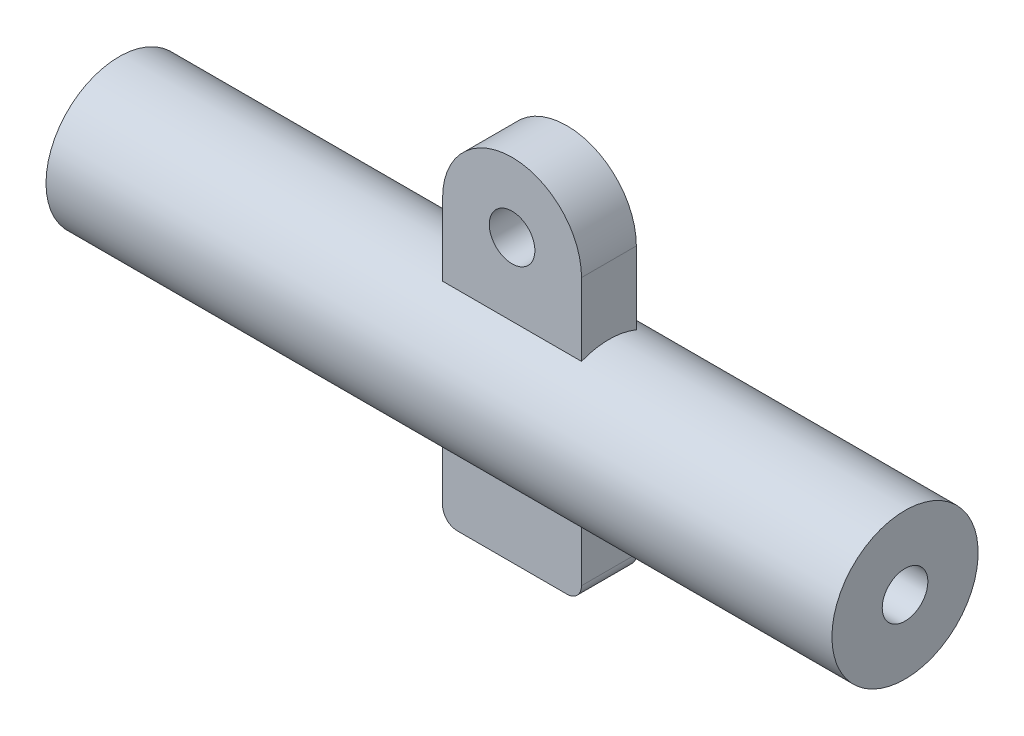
ISO-10303-21;
HEADER;
FILE_DESCRIPTION(('STEP AP214'),'2;1');
FILE_NAME('part.step','',(''),(''),'','','');
FILE_SCHEMA(('AUTOMOTIVE_DESIGN { 1 0 10303 214 1 1 1 1 }'));
ENDSEC;
DATA;
#1=APPLICATION_CONTEXT('core data for automotive mechanical design processes');
#2=APPLICATION_PROTOCOL_DEFINITION('international standard','automotive_design',2000,#1);
#3=PRODUCT_CONTEXT('',#1,'mechanical');
#4=PRODUCT('Part','Part','',(#3));
#5=PRODUCT_RELATED_PRODUCT_CATEGORY('part','',(#4));
#6=PRODUCT_DEFINITION_FORMATION('','',#4);
#7=PRODUCT_DEFINITION_CONTEXT('part definition',#1,'design');
#8=PRODUCT_DEFINITION('design','',#6,#7);
#9=PRODUCT_DEFINITION_SHAPE('','',#8);
#10=(LENGTH_UNIT() NAMED_UNIT(*) SI_UNIT(.MILLI.,.METRE.));
#11=(NAMED_UNIT(*) PLANE_ANGLE_UNIT() SI_UNIT($,.RADIAN.));
#12=(NAMED_UNIT(*) SI_UNIT($,.STERADIAN.) SOLID_ANGLE_UNIT());
#13=UNCERTAINTY_MEASURE_WITH_UNIT(LENGTH_MEASURE(1.E-05),#10,'distance_accuracy_value','');
#14=(GEOMETRIC_REPRESENTATION_CONTEXT(3) GLOBAL_UNCERTAINTY_ASSIGNED_CONTEXT((#13)) GLOBAL_UNIT_ASSIGNED_CONTEXT((#10,
#11,#12)) REPRESENTATION_CONTEXT('',''));
#15=CARTESIAN_POINT('',(0.,0.,0.));
#16=DIRECTION('',(0.,0.,1.));
#17=DIRECTION('',(1.,0.,0.));
#18=AXIS2_PLACEMENT_3D('',#15,#16,#17);
#19=CARTESIAN_POINT('',(0.,0.,0.));
#20=DIRECTION('',(-1.,0.,0.));
#21=DIRECTION('',(0.,0.,1.));
#22=AXIS2_PLACEMENT_3D('',#19,#20,#21);
#23=CYLINDRICAL_SURFACE('',#22,3.9624);
#24=CARTESIAN_POINT('',(0.,0.,0.));
#25=DIRECTION('',(-1.,0.,0.));
#26=DIRECTION('',(0.,0.,1.));
#27=AXIS2_PLACEMENT_3D('',#24,#25,#26);
#28=CIRCLE('',#27,3.9624);
#29=CARTESIAN_POINT('',(0.,0.,3.9624));
#30=VERTEX_POINT('',#29);
#31=EDGE_CURVE('E171',#30,#30,#28,.T.);
#32=ORIENTED_EDGE('',*,*,#31,.T.);
#33=EDGE_LOOP('',(#32));
#34=FACE_BOUND('',#33,.T.);
#35=CARTESIAN_POINT('',(60.96,0.,0.));
#36=DIRECTION('',(1.,0.,0.));
#37=DIRECTION('',(0.,1.,0.));
#38=AXIS2_PLACEMENT_3D('',#35,#36,#37);
#39=CIRCLE('',#38,3.9624);
#40=CARTESIAN_POINT('',(60.96,3.9624,0.));
#41=VERTEX_POINT('',#40);
#42=EDGE_CURVE('E158',#41,#41,#39,.F.);
#43=ORIENTED_EDGE('',*,*,#42,.F.);
#44=EDGE_LOOP('',(#43));
#45=FACE_BOUND('',#44,.T.);
#46=ADVANCED_FACE('F33',(#34,#45),#23,.F.);
#47=CARTESIAN_POINT('',(136.525,0.,0.));
#48=DIRECTION('',(-1.,0.,0.));
#49=DIRECTION('',(0.,0.,1.));
#50=AXIS2_PLACEMENT_3D('',#47,#48,#49);
#51=CIRCLE('',#50,3.9624);
#52=CARTESIAN_POINT('',(136.525,0.,3.9624));
#53=VERTEX_POINT('',#52);
#54=EDGE_CURVE('E168',#53,#53,#51,.T.);
#55=ORIENTED_EDGE('',*,*,#54,.F.);
#56=EDGE_LOOP('',(#55));
#57=FACE_BOUND('',#56,.T.);
#58=CARTESIAN_POINT('',(85.09,0.,0.));
#59=DIRECTION('',(-1.,0.,0.));
#60=DIRECTION('',(0.,-1.,0.));
#61=AXIS2_PLACEMENT_3D('',#58,#59,#60);
#62=CIRCLE('',#61,3.9624);
#63=CARTESIAN_POINT('',(85.09,-3.9624,0.));
#64=VERTEX_POINT('',#63);
#65=EDGE_CURVE('E155',#64,#64,#62,.F.);
#66=ORIENTED_EDGE('',*,*,#65,.F.);
#67=EDGE_LOOP('',(#66));
#68=FACE_BOUND('',#67,.T.);
#69=ADVANCED_FACE('F248',(#57,#68),#23,.F.);
#70=CARTESIAN_POINT('',(0.,0.,0.));
#71=DIRECTION('',(-1.,0.,0.));
#72=DIRECTION('',(0.,0.,1.));
#73=AXIS2_PLACEMENT_3D('',#70,#71,#72);
#74=CYLINDRICAL_SURFACE('',#73,12.7);
#75=CARTESIAN_POINT('',(60.96,0.,0.));
#76=DIRECTION('',(1.,0.,0.));
#77=DIRECTION('',(0.,1.,0.));
#78=AXIS2_PLACEMENT_3D('',#75,#76,#77);
#79=CIRCLE('',#78,12.7);
#80=CARTESIAN_POINT('',(60.96,-11.7732150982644,4.7625));
#81=VERTEX_POINT('',#80);
#82=CARTESIAN_POINT('',(60.96,-11.7732150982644,-4.7625));
#83=VERTEX_POINT('',#82);
#84=EDGE_CURVE('E184',#81,#83,#79,.T.);
#85=ORIENTED_EDGE('',*,*,#84,.F.);
#86=DIRECTION('',(-1.,0.,0.));
#87=VECTOR('',#86,1.);
#88=CARTESIAN_POINT('',(0.,-11.7732150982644,4.7625));
#89=LINE('',#88,#87);
#90=CARTESIAN_POINT('',(85.09,-11.7732150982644,4.7625));
#91=VERTEX_POINT('',#90);
#92=EDGE_CURVE('E181',#81,#91,#89,.F.);
#93=ORIENTED_EDGE('',*,*,#92,.T.);
#94=CARTESIAN_POINT('',(85.09,0.,0.));
#95=DIRECTION('',(-1.,0.,0.));
#96=DIRECTION('',(0.,-1.,0.));
#97=AXIS2_PLACEMENT_3D('',#94,#95,#96);
#98=CIRCLE('',#97,12.7);
#99=CARTESIAN_POINT('',(85.09,-11.7732150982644,-4.7625));
#100=VERTEX_POINT('',#99);
#101=EDGE_CURVE('E174',#100,#91,#98,.T.);
#102=ORIENTED_EDGE('',*,*,#101,.F.);
#103=DIRECTION('',(-1.,0.,0.));
#104=VECTOR('',#103,1.);
#105=CARTESIAN_POINT('',(0.,-11.7732150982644,-4.7625));
#106=LINE('',#105,#104);
#107=EDGE_CURVE('E177',#83,#100,#106,.F.);
#108=ORIENTED_EDGE('',*,*,#107,.F.);
#109=EDGE_LOOP('',(#85,#93,#102,#108));
#110=FACE_BOUND('',#109,.T.);
#111=CARTESIAN_POINT('',(0.,0.,0.));
#112=DIRECTION('',(-1.,0.,0.));
#113=DIRECTION('',(0.,0.,1.));
#114=AXIS2_PLACEMENT_3D('',#111,#112,#113);
#115=CIRCLE('',#114,12.7);
#116=CARTESIAN_POINT('',(0.,0.,12.7));
#117=VERTEX_POINT('',#116);
#118=EDGE_CURVE('E133',#117,#117,#115,.T.);
#119=ORIENTED_EDGE('',*,*,#118,.F.);
#120=EDGE_LOOP('',(#119));
#121=FACE_BOUND('',#120,.T.);
#122=CARTESIAN_POINT('',(136.525,0.,0.));
#123=DIRECTION('',(-1.,0.,0.));
#124=DIRECTION('',(0.,0.,1.));
#125=AXIS2_PLACEMENT_3D('',#122,#123,#124);
#126=CIRCLE('',#125,12.7);
#127=CARTESIAN_POINT('',(136.525,0.,12.7));
#128=VERTEX_POINT('',#127);
#129=EDGE_CURVE('E165',#128,#128,#126,.T.);
#130=ORIENTED_EDGE('',*,*,#129,.T.);
#131=EDGE_LOOP('',(#130));
#132=FACE_BOUND('',#131,.T.);
#133=CARTESIAN_POINT('',(60.96,11.7732150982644,-4.7625));
#134=VERTEX_POINT('',#133);
#135=CARTESIAN_POINT('',(60.96,11.7732150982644,4.7625));
#136=VERTEX_POINT('',#135);
#137=EDGE_CURVE('E159',#134,#136,#79,.T.);
#138=ORIENTED_EDGE('',*,*,#137,.F.);
#139=DIRECTION('',(-1.,0.,0.));
#140=VECTOR('',#139,1.);
#141=CARTESIAN_POINT('',(0.,11.7732150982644,-4.7625));
#142=LINE('',#141,#140);
#143=CARTESIAN_POINT('',(85.09,11.7732150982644,-4.7625));
#144=VERTEX_POINT('',#143);
#145=EDGE_CURVE('E187',#144,#134,#142,.T.);
#146=ORIENTED_EDGE('',*,*,#145,.F.);
#147=CARTESIAN_POINT('',(85.09,11.7732150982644,4.7625));
#148=VERTEX_POINT('',#147);
#149=EDGE_CURVE('E178',#148,#144,#98,.T.);
#150=ORIENTED_EDGE('',*,*,#149,.F.);
#151=DIRECTION('',(-1.,0.,0.));
#152=VECTOR('',#151,1.);
#153=CARTESIAN_POINT('',(0.,11.7732150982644,4.7625));
#154=LINE('',#153,#152);
#155=EDGE_CURVE('E120',#148,#136,#154,.T.);
#156=ORIENTED_EDGE('',*,*,#155,.T.);
#157=EDGE_LOOP('',(#138,#146,#150,#156));
#158=FACE_BOUND('',#157,.T.);
#159=ADVANCED_FACE('F230',(#110,#121,#132,#158),#74,.T.);
#160=CARTESIAN_POINT('',(0.,12.7,0.));
#161=DIRECTION('',(1.,0.,0.));
#162=DIRECTION('',(0.,0.,-1.));
#163=AXIS2_PLACEMENT_3D('',#160,#161,#162);
#164=PLANE('',#163);
#165=ORIENTED_EDGE('',*,*,#31,.F.);
#166=EDGE_LOOP('',(#165));
#167=FACE_BOUND('',#166,.T.);
#168=ORIENTED_EDGE('',*,*,#118,.T.);
#169=EDGE_LOOP('',(#168));
#170=FACE_BOUND('',#169,.T.);
#171=ADVANCED_FACE('F260',(#167,#170),#164,.F.);
#172=CARTESIAN_POINT('',(136.525,3.9624,0.));
#173=DIRECTION('',(-1.,0.,0.));
#174=DIRECTION('',(0.,0.,1.));
#175=AXIS2_PLACEMENT_3D('',#172,#173,#174);
#176=PLANE('',#175);
#177=ORIENTED_EDGE('',*,*,#129,.F.);
#178=EDGE_LOOP('',(#177));
#179=FACE_BOUND('',#178,.T.);
#180=ORIENTED_EDGE('',*,*,#54,.T.);
#181=EDGE_LOOP('',(#180));
#182=FACE_BOUND('',#181,.T.);
#183=ADVANCED_FACE('F258',(#179,#182),#176,.F.);
#184=CARTESIAN_POINT('',(60.96,-24.511,4.7625));
#185=DIRECTION('',(0.,1.,0.));
#186=DIRECTION('',(0.,0.,1.));
#187=AXIS2_PLACEMENT_3D('',#184,#185,#186);
#188=PLANE('',#187);
#189=DIRECTION('',(1.,0.,0.));
#190=VECTOR('',#189,1.);
#191=CARTESIAN_POINT('',(60.96,-24.511,4.7625));
#192=LINE('',#191,#190);
#193=CARTESIAN_POINT('',(63.5,-24.511,4.7625));
#194=VERTEX_POINT('',#193);
#195=CARTESIAN_POINT('',(82.55,-24.511,4.7625));
#196=VERTEX_POINT('',#195);
#197=EDGE_CURVE('E124',#194,#196,#192,.T.);
#198=ORIENTED_EDGE('',*,*,#197,.F.);
#199=DIRECTION('',(0.,0.,-1.));
#200=VECTOR('',#199,1.);
#201=CARTESIAN_POINT('',(63.5,-24.511,4.7625));
#202=LINE('',#201,#200);
#203=CARTESIAN_POINT('',(63.5,-24.511,-4.7625));
#204=VERTEX_POINT('',#203);
#205=EDGE_CURVE('E192',#194,#204,#202,.T.);
#206=ORIENTED_EDGE('',*,*,#205,.T.);
#207=DIRECTION('',(1.,0.,0.));
#208=VECTOR('',#207,1.);
#209=CARTESIAN_POINT('',(60.96,-24.511,-4.7625));
#210=LINE('',#209,#208);
#211=CARTESIAN_POINT('',(82.55,-24.511,-4.7625));
#212=VERTEX_POINT('',#211);
#213=EDGE_CURVE('E146',#204,#212,#210,.T.);
#214=ORIENTED_EDGE('',*,*,#213,.T.);
#215=DIRECTION('',(0.,0.,-1.));
#216=VECTOR('',#215,1.);
#217=CARTESIAN_POINT('',(82.55,-24.511,4.7625));
#218=LINE('',#217,#216);
#219=EDGE_CURVE('E162',#212,#196,#218,.F.);
#220=ORIENTED_EDGE('',*,*,#219,.T.);
#221=EDGE_LOOP('',(#198,#206,#214,#220));
#222=FACE_BOUND('',#221,.T.);
#223=ADVANCED_FACE('F207',(#222),#188,.F.);
#224=CARTESIAN_POINT('',(85.09,-24.511,4.7625));
#225=DIRECTION('',(-1.,0.,0.));
#226=DIRECTION('',(0.,-1.,0.));
#227=AXIS2_PLACEMENT_3D('',#224,#225,#226);
#228=PLANE('',#227);
#229=DIRECTION('',(0.,1.,0.));
#230=VECTOR('',#229,1.);
#231=CARTESIAN_POINT('',(85.09,-24.511,4.7625));
#232=LINE('',#231,#230);
#233=CARTESIAN_POINT('',(85.09,-21.971,4.7625));
#234=VERTEX_POINT('',#233);
#235=EDGE_CURVE('E123',#234,#91,#232,.T.);
#236=ORIENTED_EDGE('',*,*,#235,.F.);
#237=DIRECTION('',(0.,0.,-1.));
#238=VECTOR('',#237,1.);
#239=CARTESIAN_POINT('',(85.09,-21.971,4.7625));
#240=LINE('',#239,#238);
#241=CARTESIAN_POINT('',(85.09,-21.971,-4.7625));
#242=VERTEX_POINT('',#241);
#243=EDGE_CURVE('E11',#234,#242,#240,.T.);
#244=ORIENTED_EDGE('',*,*,#243,.T.);
#245=DIRECTION('',(0.,1.,0.));
#246=VECTOR('',#245,1.);
#247=CARTESIAN_POINT('',(85.09,-24.511,-4.7625));
#248=LINE('',#247,#246);
#249=EDGE_CURVE('E150',#242,#100,#248,.T.);
#250=ORIENTED_EDGE('',*,*,#249,.T.);
#251=ORIENTED_EDGE('',*,*,#101,.T.);
#252=EDGE_LOOP('',(#236,#244,#250,#251));
#253=FACE_BOUND('',#252,.T.);
#254=ADVANCED_FACE('F275',(#253),#228,.F.);
#255=CARTESIAN_POINT('',(60.96,24.384,4.7625));
#256=DIRECTION('',(1.,0.,0.));
#257=DIRECTION('',(0.,1.,0.));
#258=AXIS2_PLACEMENT_3D('',#255,#256,#257);
#259=PLANE('',#258);
#260=DIRECTION('',(0.,-1.,0.));
#261=VECTOR('',#260,1.);
#262=CARTESIAN_POINT('',(60.96,24.384,-4.7625));
#263=LINE('',#262,#261);
#264=CARTESIAN_POINT('',(60.96,-21.971,-4.7625));
#265=VERTEX_POINT('',#264);
#266=EDGE_CURVE('E147',#83,#265,#263,.T.);
#267=ORIENTED_EDGE('',*,*,#266,.T.);
#268=DIRECTION('',(0.,0.,-1.));
#269=VECTOR('',#268,1.);
#270=CARTESIAN_POINT('',(60.96,-21.971,4.7625));
#271=LINE('',#270,#269);
#272=CARTESIAN_POINT('',(60.96,-21.971,4.7625));
#273=VERTEX_POINT('',#272);
#274=EDGE_CURVE('E56',#265,#273,#271,.F.);
#275=ORIENTED_EDGE('',*,*,#274,.T.);
#276=DIRECTION('',(0.,-1.,0.));
#277=VECTOR('',#276,1.);
#278=CARTESIAN_POINT('',(60.96,24.384,4.7625));
#279=LINE('',#278,#277);
#280=EDGE_CURVE('E153',#81,#273,#279,.T.);
#281=ORIENTED_EDGE('',*,*,#280,.F.);
#282=ORIENTED_EDGE('',*,*,#84,.T.);
#283=EDGE_LOOP('',(#267,#275,#281,#282));
#284=FACE_BOUND('',#283,.T.);
#285=ADVANCED_FACE('F215',(#284),#259,.F.);
#286=CARTESIAN_POINT('',(73.025,24.384,-4.7625));
#287=DIRECTION('',(0.,0.,1.));
#288=DIRECTION('',(1.,0.,0.));
#289=AXIS2_PLACEMENT_3D('',#286,#287,#288);
#290=PLANE('',#289);
#291=ORIENTED_EDGE('',*,*,#213,.F.);
#292=CARTESIAN_POINT('',(63.5,-21.971,-4.7625));
#293=DIRECTION('',(0.,0.,1.));
#294=DIRECTION('',(1.,0.,0.));
#295=AXIS2_PLACEMENT_3D('',#292,#293,#294);
#296=CIRCLE('',#295,2.54);
#297=EDGE_CURVE('E197',#204,#265,#296,.F.);
#298=ORIENTED_EDGE('',*,*,#297,.T.);
#299=ORIENTED_EDGE('',*,*,#266,.F.);
#300=ORIENTED_EDGE('',*,*,#107,.T.);
#301=ORIENTED_EDGE('',*,*,#249,.F.);
#302=CARTESIAN_POINT('',(82.55,-21.971,-4.7625));
#303=DIRECTION('',(0.,0.,1.));
#304=DIRECTION('',(1.,0.,0.));
#305=AXIS2_PLACEMENT_3D('',#302,#303,#304);
#306=CIRCLE('',#305,2.54);
#307=EDGE_CURVE('E195',#242,#212,#306,.F.);
#308=ORIENTED_EDGE('',*,*,#307,.T.);
#309=EDGE_LOOP('',(#291,#298,#299,#300,#301,#308));
#310=FACE_BOUND('',#309,.T.);
#311=ADVANCED_FACE('F214',(#310),#290,.F.);
#312=CARTESIAN_POINT('',(73.025,24.384,4.7625));
#313=DIRECTION('',(0.,0.,1.));
#314=DIRECTION('',(1.,0.,0.));
#315=AXIS2_PLACEMENT_3D('',#312,#313,#314);
#316=PLANE('',#315);
#317=ORIENTED_EDGE('',*,*,#280,.T.);
#318=CARTESIAN_POINT('',(63.5,-21.971,4.7625));
#319=DIRECTION('',(0.,0.,1.));
#320=DIRECTION('',(1.,0.,0.));
#321=AXIS2_PLACEMENT_3D('',#318,#319,#320);
#322=CIRCLE('',#321,2.54);
#323=EDGE_CURVE('E41',#273,#194,#322,.T.);
#324=ORIENTED_EDGE('',*,*,#323,.T.);
#325=ORIENTED_EDGE('',*,*,#197,.T.);
#326=CARTESIAN_POINT('',(82.55,-21.971,4.7625));
#327=DIRECTION('',(0.,0.,1.));
#328=DIRECTION('',(1.,0.,0.));
#329=AXIS2_PLACEMENT_3D('',#326,#327,#328);
#330=CIRCLE('',#329,2.54);
#331=EDGE_CURVE('E48',#196,#234,#330,.T.);
#332=ORIENTED_EDGE('',*,*,#331,.T.);
#333=ORIENTED_EDGE('',*,*,#235,.T.);
#334=ORIENTED_EDGE('',*,*,#92,.F.);
#335=EDGE_LOOP('',(#317,#324,#325,#332,#333,#334));
#336=FACE_BOUND('',#335,.T.);
#337=ADVANCED_FACE('F202',(#336),#316,.T.);
#338=CARTESIAN_POINT('',(73.025,24.384,4.7625));
#339=DIRECTION('',(0.,0.,-1.));
#340=DIRECTION('',(-1.,0.,0.));
#341=AXIS2_PLACEMENT_3D('',#338,#339,#340);
#342=CYLINDRICAL_SURFACE('',#341,3.9624);
#343=CARTESIAN_POINT('',(73.025,24.384,4.7625));
#344=DIRECTION('',(0.,0.,1.));
#345=DIRECTION('',(1.,0.,0.));
#346=AXIS2_PLACEMENT_3D('',#343,#344,#345);
#347=CIRCLE('',#346,3.9624);
#348=CARTESIAN_POINT('',(69.0626,24.384,4.7625));
#349=VERTEX_POINT('',#348);
#350=EDGE_CURVE('E216',#349,#349,#347,.T.);
#351=CARTESIAN_POINT('',(73.025,24.384,-4.7625));
#352=DIRECTION('',(0.,0.,1.));
#353=DIRECTION('',(1.,0.,0.));
#354=AXIS2_PLACEMENT_3D('',#351,#352,#353);
#355=CIRCLE('',#354,3.9624);
#356=CARTESIAN_POINT('',(69.0626,24.384,-4.7625));
#357=VERTEX_POINT('',#356);
#358=EDGE_CURVE('E218',#357,#357,#355,.T.);
#359=CARTESIAN_POINT('',(69.0626,24.384,4.7625));
#360=CARTESIAN_POINT('',(69.0626,24.384,4.66328125));
#361=CARTESIAN_POINT('',(69.0626,24.384,4.5640625));
#362=CARTESIAN_POINT('',(69.0626,24.384,4.365625));
#363=CARTESIAN_POINT('',(69.0626,24.384,4.26640625));
#364=CARTESIAN_POINT('',(69.0626,24.384,4.06796875));
#365=CARTESIAN_POINT('',(69.0626,24.384,3.96875));
#366=CARTESIAN_POINT('',(69.0626,24.384,3.7703125));
#367=CARTESIAN_POINT('',(69.0626,24.384,3.67109375));
#368=CARTESIAN_POINT('',(69.0626,24.384,3.47265625));
#369=CARTESIAN_POINT('',(69.0626,24.384,3.3734375));
#370=CARTESIAN_POINT('',(69.0626,24.384,3.175));
#371=CARTESIAN_POINT('',(69.0626,24.384,3.07578125));
#372=CARTESIAN_POINT('',(69.0626,24.384,2.87734375));
#373=CARTESIAN_POINT('',(69.0626,24.384,2.778125));
#374=CARTESIAN_POINT('',(69.0626,24.384,2.5796875));
#375=CARTESIAN_POINT('',(69.0626,24.384,2.48046875));
#376=CARTESIAN_POINT('',(69.0626,24.384,2.28203125));
#377=CARTESIAN_POINT('',(69.0626,24.384,2.1828125));
#378=CARTESIAN_POINT('',(69.0626,24.384,1.984375));
#379=CARTESIAN_POINT('',(69.0626,24.384,1.88515625));
#380=CARTESIAN_POINT('',(69.0626,24.384,1.68671875));
#381=CARTESIAN_POINT('',(69.0626,24.384,1.5875));
#382=CARTESIAN_POINT('',(69.0626,24.384,1.3890625));
#383=CARTESIAN_POINT('',(69.0626,24.384,1.28984375));
#384=CARTESIAN_POINT('',(69.0626,24.384,1.09140625));
#385=CARTESIAN_POINT('',(69.0626,24.384,0.992187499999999));
#386=CARTESIAN_POINT('',(69.0626,24.384,0.793749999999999));
#387=CARTESIAN_POINT('',(69.0626,24.384,0.694531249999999));
#388=CARTESIAN_POINT('',(69.0626,24.384,0.496093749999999));
#389=CARTESIAN_POINT('',(69.0626,24.384,0.396874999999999));
#390=CARTESIAN_POINT('',(69.0626,24.384,0.198437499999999));
#391=CARTESIAN_POINT('',(69.0626,24.384,0.0992187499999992));
#392=CARTESIAN_POINT('',(69.0626,24.384,-0.0992187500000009));
#393=CARTESIAN_POINT('',(69.0626,24.384,-0.198437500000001));
#394=CARTESIAN_POINT('',(69.0626,24.384,-0.396875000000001));
#395=CARTESIAN_POINT('',(69.0626,24.384,-0.496093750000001));
#396=CARTESIAN_POINT('',(69.0626,24.384,-0.694531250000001));
#397=CARTESIAN_POINT('',(69.0626,24.384,-0.793750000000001));
#398=CARTESIAN_POINT('',(69.0626,24.384,-0.992187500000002));
#399=CARTESIAN_POINT('',(69.0626,24.384,-1.09140625));
#400=CARTESIAN_POINT('',(69.0626,24.384,-1.28984375));
#401=CARTESIAN_POINT('',(69.0626,24.384,-1.3890625));
#402=CARTESIAN_POINT('',(69.0626,24.384,-1.5875));
#403=CARTESIAN_POINT('',(69.0626,24.384,-1.68671875));
#404=CARTESIAN_POINT('',(69.0626,24.384,-1.88515625));
#405=CARTESIAN_POINT('',(69.0626,24.384,-1.984375));
#406=CARTESIAN_POINT('',(69.0626,24.384,-2.1828125));
#407=CARTESIAN_POINT('',(69.0626,24.384,-2.28203125));
#408=CARTESIAN_POINT('',(69.0626,24.384,-2.48046875));
#409=CARTESIAN_POINT('',(69.0626,24.384,-2.5796875));
#410=CARTESIAN_POINT('',(69.0626,24.384,-2.778125));
#411=CARTESIAN_POINT('',(69.0626,24.384,-2.87734375));
#412=CARTESIAN_POINT('',(69.0626,24.384,-3.07578125));
#413=CARTESIAN_POINT('',(69.0626,24.384,-3.175));
#414=CARTESIAN_POINT('',(69.0626,24.384,-3.3734375));
#415=CARTESIAN_POINT('',(69.0626,24.384,-3.47265625));
#416=CARTESIAN_POINT('',(69.0626,24.384,-3.67109375));
#417=CARTESIAN_POINT('',(69.0626,24.384,-3.7703125));
#418=CARTESIAN_POINT('',(69.0626,24.384,-3.96875));
#419=CARTESIAN_POINT('',(69.0626,24.384,-4.06796875));
#420=CARTESIAN_POINT('',(69.0626,24.384,-4.26640625));
#421=CARTESIAN_POINT('',(69.0626,24.384,-4.365625));
#422=CARTESIAN_POINT('',(69.0626,24.384,-4.5640625));
#423=CARTESIAN_POINT('',(69.0626,24.384,-4.66328125));
#424=CARTESIAN_POINT('',(69.0626,24.384,-4.7625));
#425=B_SPLINE_CURVE_WITH_KNOTS('',3,(#359,#360,#361,#362,#363,#364,#365,#366,#367,#368,#369,
#370,#371,#372,#373,#374,#375,#376,#377,#378,#379,#380,#381,#382,#383,#384,#385,#386,#387,#388,
#389,#390,#391,#392,#393,#394,#395,#396,#397,#398,#399,#400,#401,#402,#403,#404,#405,#406,#407,
#408,#409,#410,#411,#412,#413,#414,#415,#416,#417,#418,#419,#420,#421,#422,#423,#424),
.UNSPECIFIED.,.F.,.F.,(4,2,2,2,2,2,2,2,2,2,2,2,2,2,2,2,2,2,2,2,2,2,2,2,2,2,2,2,2,2,2,2,4),(0.,
0.297656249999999,0.595312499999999,0.89296875,1.190625,1.48828125,1.7859375,2.08359375,2.38125,
2.67890625,2.9765625,3.27421875,3.571875,3.86953125,4.1671875,4.46484375,4.7625,5.06015625,
5.3578125,5.65546875,5.953125,6.25078125,6.5484375,6.84609375,7.14375,7.44140625,7.7390625,
8.03671875,8.334375,8.63203125,8.9296875,9.22734375,9.525),.UNSPECIFIED.);
#426=EDGE_CURVE('BSEAM289',#349,#357,#425,.T.);
#427=ORIENTED_EDGE('',*,*,#350,.T.);
#428=ORIENTED_EDGE('',*,*,#358,.F.);
#429=ORIENTED_EDGE('',*,*,#426,.T.);
#430=ORIENTED_EDGE('',*,*,#426,.F.);
#431=EDGE_LOOP('',(#427,#429,#428,#430));
#432=FACE_BOUND('',#431,.T.);
#433=ADVANCED_FACE('F289',(#432),#342,.F.);
#434=CARTESIAN_POINT('',(73.025,24.384,4.7625));
#435=DIRECTION('',(0.,0.,-1.));
#436=DIRECTION('',(-1.,0.,0.));
#437=AXIS2_PLACEMENT_3D('',#434,#435,#436);
#438=CYLINDRICAL_SURFACE('',#437,12.065);
#439=CARTESIAN_POINT('',(73.025,24.384,-4.7625));
#440=DIRECTION('',(0.,0.,1.));
#441=DIRECTION('',(1.,0.,0.));
#442=AXIS2_PLACEMENT_3D('',#439,#440,#441);
#443=CIRCLE('',#442,12.065);
#444=CARTESIAN_POINT('',(85.09,24.384,-4.7625));
#445=VERTEX_POINT('',#444);
#446=CARTESIAN_POINT('',(60.96,24.384,-4.7625));
#447=VERTEX_POINT('',#446);
#448=EDGE_CURVE('E152',#445,#447,#443,.T.);
#449=ORIENTED_EDGE('',*,*,#448,.T.);
#450=DIRECTION('',(0.,0.,-1.));
#451=VECTOR('',#450,1.);
#452=CARTESIAN_POINT('',(60.96,24.384,4.7625));
#453=LINE('',#452,#451);
#454=CARTESIAN_POINT('',(60.96,24.384,4.7625));
#455=VERTEX_POINT('',#454);
#456=EDGE_CURVE('E134',#455,#447,#453,.T.);
#457=ORIENTED_EDGE('',*,*,#456,.F.);
#458=CARTESIAN_POINT('',(73.025,24.384,4.7625));
#459=DIRECTION('',(0.,0.,1.));
#460=DIRECTION('',(1.,0.,0.));
#461=AXIS2_PLACEMENT_3D('',#458,#459,#460);
#462=CIRCLE('',#461,12.065);
#463=CARTESIAN_POINT('',(85.09,24.384,4.7625));
#464=VERTEX_POINT('',#463);
#465=EDGE_CURVE('E118',#464,#455,#462,.T.);
#466=ORIENTED_EDGE('',*,*,#465,.F.);
#467=DIRECTION('',(0.,0.,-1.));
#468=VECTOR('',#467,1.);
#469=CARTESIAN_POINT('',(85.09,24.384,4.7625));
#470=LINE('',#469,#468);
#471=EDGE_CURVE('E127',#464,#445,#470,.T.);
#472=ORIENTED_EDGE('',*,*,#471,.T.);
#473=EDGE_LOOP('',(#449,#457,#466,#472));
#474=FACE_BOUND('',#473,.T.);
#475=ADVANCED_FACE('F136',(#474),#438,.T.);
#476=EDGE_CURVE('E113',#148,#464,#232,.T.);
#477=ORIENTED_EDGE('',*,*,#476,.F.);
#478=ORIENTED_EDGE('',*,*,#149,.T.);
#479=EDGE_CURVE('E130',#144,#445,#248,.T.);
#480=ORIENTED_EDGE('',*,*,#479,.T.);
#481=ORIENTED_EDGE('',*,*,#471,.F.);
#482=EDGE_LOOP('',(#477,#478,#480,#481));
#483=FACE_BOUND('',#482,.T.);
#484=ADVANCED_FACE('F128',(#483),#228,.F.);
#485=EDGE_CURVE('E143',#447,#134,#263,.T.);
#486=ORIENTED_EDGE('',*,*,#485,.T.);
#487=ORIENTED_EDGE('',*,*,#137,.T.);
#488=EDGE_CURVE('E210',#455,#136,#279,.T.);
#489=ORIENTED_EDGE('',*,*,#488,.F.);
#490=ORIENTED_EDGE('',*,*,#456,.T.);
#491=EDGE_LOOP('',(#486,#487,#489,#490));
#492=FACE_BOUND('',#491,.T.);
#493=ADVANCED_FACE('F227',(#492),#259,.F.);
#494=ORIENTED_EDGE('',*,*,#358,.T.);
#495=EDGE_LOOP('',(#494));
#496=FACE_BOUND('',#495,.T.);
#497=ORIENTED_EDGE('',*,*,#479,.F.);
#498=ORIENTED_EDGE('',*,*,#145,.T.);
#499=ORIENTED_EDGE('',*,*,#485,.F.);
#500=ORIENTED_EDGE('',*,*,#448,.F.);
#501=EDGE_LOOP('',(#497,#498,#499,#500));
#502=FACE_BOUND('',#501,.T.);
#503=ADVANCED_FACE('F232',(#496,#502),#290,.F.);
#504=ORIENTED_EDGE('',*,*,#350,.F.);
#505=EDGE_LOOP('',(#504));
#506=FACE_BOUND('',#505,.T.);
#507=ORIENTED_EDGE('',*,*,#155,.F.);
#508=ORIENTED_EDGE('',*,*,#476,.T.);
#509=ORIENTED_EDGE('',*,*,#465,.T.);
#510=ORIENTED_EDGE('',*,*,#488,.T.);
#511=EDGE_LOOP('',(#507,#508,#509,#510));
#512=FACE_BOUND('',#511,.T.);
#513=ADVANCED_FACE('F115',(#506,#512),#316,.T.);
#514=ORIENTED_EDGE('',*,*,#65,.T.);
#515=EDGE_LOOP('',(#514));
#516=FACE_BOUND('',#515,.T.);
#517=ADVANCED_FACE('F240',(#516),#228,.F.);
#518=ORIENTED_EDGE('',*,*,#42,.T.);
#519=EDGE_LOOP('',(#518));
#520=FACE_BOUND('',#519,.T.);
#521=ADVANCED_FACE('F244',(#520),#259,.F.);
#522=CARTESIAN_POINT('',(63.5,-21.971,4.7625));
#523=DIRECTION('',(0.,0.,-1.));
#524=DIRECTION('',(-1.,0.,0.));
#525=AXIS2_PLACEMENT_3D('',#522,#523,#524);
#526=CYLINDRICAL_SURFACE('',#525,2.54);
#527=ORIENTED_EDGE('',*,*,#323,.F.);
#528=ORIENTED_EDGE('',*,*,#274,.F.);
#529=ORIENTED_EDGE('',*,*,#297,.F.);
#530=ORIENTED_EDGE('',*,*,#205,.F.);
#531=EDGE_LOOP('',(#527,#528,#529,#530));
#532=FACE_BOUND('',#531,.T.);
#533=ADVANCED_FACE('F211',(#532),#526,.T.);
#534=CARTESIAN_POINT('',(82.55,-21.971,4.7625));
#535=DIRECTION('',(0.,0.,-1.));
#536=DIRECTION('',(-1.,0.,0.));
#537=AXIS2_PLACEMENT_3D('',#534,#535,#536);
#538=CYLINDRICAL_SURFACE('',#537,2.54);
#539=ORIENTED_EDGE('',*,*,#331,.F.);
#540=ORIENTED_EDGE('',*,*,#219,.F.);
#541=ORIENTED_EDGE('',*,*,#307,.F.);
#542=ORIENTED_EDGE('',*,*,#243,.F.);
#543=EDGE_LOOP('',(#539,#540,#541,#542));
#544=FACE_BOUND('',#543,.T.);
#545=ADVANCED_FACE('F35',(#544),#538,.T.);
#546=CLOSED_SHELL('',(#46,#69,#159,#171,#183,#223,#254,#285,#311,#337,#433,#475,#484,#493,#503,
#513,#517,#521,#533,#545));
#547=MANIFOLD_SOLID_BREP('B2',#546);
#548=ADVANCED_BREP_SHAPE_REPRESENTATION('',(#18,#547),#14);
#549=SHAPE_DEFINITION_REPRESENTATION(#9,#548);
ENDSEC;
END-ISO-10303-21;
